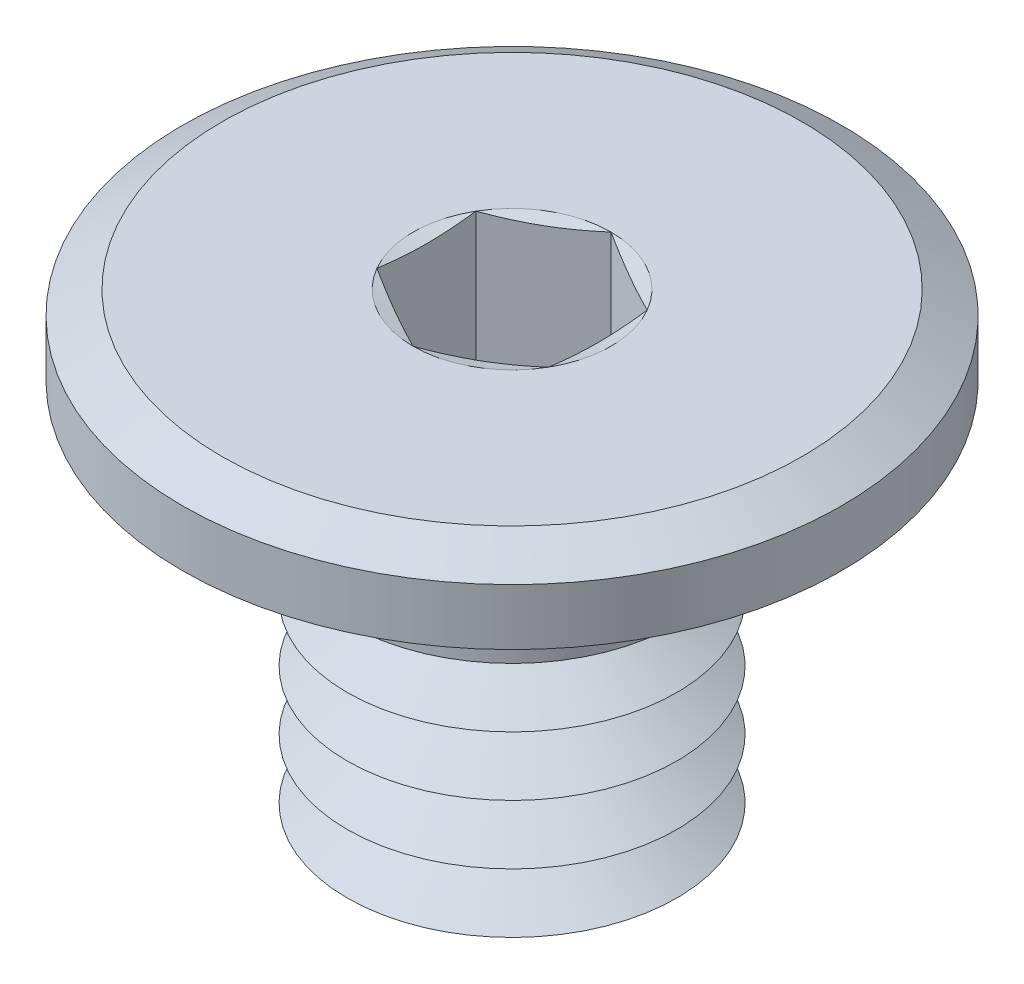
ISO-10303-21;
HEADER;
FILE_DESCRIPTION(('STEP AP214'),'2;1');
FILE_NAME('part.step','',(''),(''),'','','');
FILE_SCHEMA(('AUTOMOTIVE_DESIGN { 1 0 10303 214 1 1 1 1 }'));
ENDSEC;
DATA;
#1=APPLICATION_CONTEXT('core data for automotive mechanical design processes');
#2=APPLICATION_PROTOCOL_DEFINITION('international standard','automotive_design',2000,#1);
#3=PRODUCT_CONTEXT('',#1,'mechanical');
#4=PRODUCT('Part','Part','',(#3));
#5=PRODUCT_RELATED_PRODUCT_CATEGORY('part','',(#4));
#6=PRODUCT_DEFINITION_FORMATION('','',#4);
#7=PRODUCT_DEFINITION_CONTEXT('part definition',#1,'design');
#8=PRODUCT_DEFINITION('design','',#6,#7);
#9=PRODUCT_DEFINITION_SHAPE('','',#8);
#10=(LENGTH_UNIT() NAMED_UNIT(*) SI_UNIT(.MILLI.,.METRE.));
#11=(NAMED_UNIT(*) PLANE_ANGLE_UNIT() SI_UNIT($,.RADIAN.));
#12=(NAMED_UNIT(*) SI_UNIT($,.STERADIAN.) SOLID_ANGLE_UNIT());
#13=UNCERTAINTY_MEASURE_WITH_UNIT(LENGTH_MEASURE(1.E-05),#10,'distance_accuracy_value','');
#14=(GEOMETRIC_REPRESENTATION_CONTEXT(3) GLOBAL_UNCERTAINTY_ASSIGNED_CONTEXT((#13)) GLOBAL_UNIT_ASSIGNED_CONTEXT((#10,
#11,#12)) REPRESENTATION_CONTEXT('',''));
#15=CARTESIAN_POINT('',(0.,0.,0.));
#16=DIRECTION('',(0.,0.,1.));
#17=DIRECTION('',(1.,0.,0.));
#18=AXIS2_PLACEMENT_3D('',#15,#16,#17);
#19=CARTESIAN_POINT('',(0.,-2.925,0.));
#20=DIRECTION('',(0.,-1.,0.));
#21=DIRECTION('',(0.,0.,-1.));
#22=AXIS2_PLACEMENT_3D('',#19,#20,#21);
#23=CONICAL_SURFACE('',#22,1.25,1.0471975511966);
#24=CARTESIAN_POINT('',(0.,-2.7,0.));
#25=DIRECTION('',(0.,1.,0.));
#26=DIRECTION('',(0.,0.,1.));
#27=AXIS2_PLACEMENT_3D('',#24,#25,#26);
#28=CIRCLE('',#27,0.860288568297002);
#29=CARTESIAN_POINT('',(0.,-2.7,0.860288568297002));
#30=VERTEX_POINT('',#29);
#31=EDGE_CURVE('E394',#30,#30,#28,.T.);
#32=ORIENTED_EDGE('',*,*,#31,.F.);
#33=EDGE_LOOP('',(#32));
#34=FACE_BOUND('',#33,.T.);
#35=CARTESIAN_POINT('',(0.,-2.925,0.));
#36=DIRECTION('',(0.,1.,0.));
#37=DIRECTION('',(0.,0.,1.));
#38=AXIS2_PLACEMENT_3D('',#35,#36,#37);
#39=CIRCLE('',#38,1.25);
#40=CARTESIAN_POINT('',(0.,-2.925,1.25));
#41=VERTEX_POINT('',#40);
#42=EDGE_CURVE('E397',#41,#41,#39,.T.);
#43=ORIENTED_EDGE('',*,*,#42,.T.);
#44=EDGE_LOOP('',(#43));
#45=FACE_BOUND('',#44,.T.);
#46=ADVANCED_FACE('F39',(#34,#45),#23,.T.);
#47=CARTESIAN_POINT('',(0.,-2.7,0.));
#48=DIRECTION('',(0.,1.,0.));
#49=DIRECTION('',(0.,0.,1.));
#50=AXIS2_PLACEMENT_3D('',#47,#48,#49);
#51=CONICAL_SURFACE('',#50,0.860288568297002,1.0471975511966);
#52=CARTESIAN_POINT('',(0.,-2.475,0.));
#53=DIRECTION('',(0.,1.,0.));
#54=DIRECTION('',(0.,0.,1.));
#55=AXIS2_PLACEMENT_3D('',#52,#53,#54);
#56=CIRCLE('',#55,1.25);
#57=CARTESIAN_POINT('',(0.,-2.475,1.25));
#58=VERTEX_POINT('',#57);
#59=EDGE_CURVE('E390',#58,#58,#56,.T.);
#60=ORIENTED_EDGE('',*,*,#59,.F.);
#61=EDGE_LOOP('',(#60));
#62=FACE_BOUND('',#61,.T.);
#63=ORIENTED_EDGE('',*,*,#31,.T.);
#64=EDGE_LOOP('',(#63));
#65=FACE_BOUND('',#64,.T.);
#66=ADVANCED_FACE('F233',(#62,#65),#51,.T.);
#67=CARTESIAN_POINT('',(0.,-3.6,0.));
#68=DIRECTION('',(0.,-1.,0.));
#69=DIRECTION('',(0.,0.,-1.));
#70=AXIS2_PLACEMENT_3D('',#67,#68,#69);
#71=PLANE('',#70);
#72=CARTESIAN_POINT('',(0.,-3.6,0.));
#73=DIRECTION('',(0.,1.,0.));
#74=DIRECTION('',(0.,0.,1.));
#75=AXIS2_PLACEMENT_3D('',#72,#73,#74);
#76=CIRCLE('',#75,0.860288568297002);
#77=CARTESIAN_POINT('',(0.,-3.6,0.860288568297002));
#78=VERTEX_POINT('',#77);
#79=EDGE_CURVE('E300',#78,#78,#76,.T.);
#80=ORIENTED_EDGE('',*,*,#79,.F.);
#81=EDGE_LOOP('',(#80));
#82=FACE_BOUND('',#81,.T.);
#83=ADVANCED_FACE('F239',(#82),#71,.T.);
#84=CARTESIAN_POINT('',(0.,-3.6,0.));
#85=DIRECTION('',(0.,1.,0.));
#86=DIRECTION('',(0.,0.,1.));
#87=AXIS2_PLACEMENT_3D('',#84,#85,#86);
#88=CONICAL_SURFACE('',#87,0.860288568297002,1.0471975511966);
#89=CARTESIAN_POINT('',(0.,-3.375,0.));
#90=DIRECTION('',(0.,1.,0.));
#91=DIRECTION('',(0.,0.,1.));
#92=AXIS2_PLACEMENT_3D('',#89,#90,#91);
#93=CIRCLE('',#92,1.25);
#94=CARTESIAN_POINT('',(0.,-3.375,1.25));
#95=VERTEX_POINT('',#94);
#96=EDGE_CURVE('E405',#95,#95,#93,.T.);
#97=ORIENTED_EDGE('',*,*,#96,.F.);
#98=EDGE_LOOP('',(#97));
#99=FACE_BOUND('',#98,.T.);
#100=ORIENTED_EDGE('',*,*,#79,.T.);
#101=EDGE_LOOP('',(#100));
#102=FACE_BOUND('',#101,.T.);
#103=ADVANCED_FACE('F254',(#99,#102),#88,.T.);
#104=CARTESIAN_POINT('',(0.,-3.375,0.));
#105=DIRECTION('',(0.,-1.,0.));
#106=DIRECTION('',(0.,0.,-1.));
#107=AXIS2_PLACEMENT_3D('',#104,#105,#106);
#108=CONICAL_SURFACE('',#107,1.25,1.0471975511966);
#109=CARTESIAN_POINT('',(0.,-3.15,0.));
#110=DIRECTION('',(0.,1.,0.));
#111=DIRECTION('',(0.,0.,1.));
#112=AXIS2_PLACEMENT_3D('',#109,#110,#111);
#113=CIRCLE('',#112,0.860288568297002);
#114=CARTESIAN_POINT('',(0.,-3.15,0.860288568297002));
#115=VERTEX_POINT('',#114);
#116=EDGE_CURVE('E401',#115,#115,#113,.T.);
#117=ORIENTED_EDGE('',*,*,#116,.F.);
#118=EDGE_LOOP('',(#117));
#119=FACE_BOUND('',#118,.T.);
#120=ORIENTED_EDGE('',*,*,#96,.T.);
#121=EDGE_LOOP('',(#120));
#122=FACE_BOUND('',#121,.T.);
#123=ADVANCED_FACE('F250',(#119,#122),#108,.T.);
#124=CARTESIAN_POINT('',(0.,-3.15,0.));
#125=DIRECTION('',(0.,1.,0.));
#126=DIRECTION('',(0.,0.,1.));
#127=AXIS2_PLACEMENT_3D('',#124,#125,#126);
#128=CONICAL_SURFACE('',#127,0.860288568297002,1.0471975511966);
#129=ORIENTED_EDGE('',*,*,#42,.F.);
#130=EDGE_LOOP('',(#129));
#131=FACE_BOUND('',#130,.T.);
#132=ORIENTED_EDGE('',*,*,#116,.T.);
#133=EDGE_LOOP('',(#132));
#134=FACE_BOUND('',#133,.T.);
#135=ADVANCED_FACE('F246',(#131,#134),#128,.T.);
#136=CARTESIAN_POINT('',(0.,-2.475,0.));
#137=DIRECTION('',(0.,-1.,0.));
#138=DIRECTION('',(0.,0.,-1.));
#139=AXIS2_PLACEMENT_3D('',#136,#137,#138);
#140=CONICAL_SURFACE('',#139,1.25,1.0471975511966);
#141=CARTESIAN_POINT('',(0.,-2.25,0.));
#142=DIRECTION('',(0.,1.,0.));
#143=DIRECTION('',(0.,0.,1.));
#144=AXIS2_PLACEMENT_3D('',#141,#142,#143);
#145=CIRCLE('',#144,0.860288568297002);
#146=CARTESIAN_POINT('',(0.,-2.25,0.860288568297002));
#147=VERTEX_POINT('',#146);
#148=EDGE_CURVE('E386',#147,#147,#145,.T.);
#149=ORIENTED_EDGE('',*,*,#148,.F.);
#150=EDGE_LOOP('',(#149));
#151=FACE_BOUND('',#150,.T.);
#152=ORIENTED_EDGE('',*,*,#59,.T.);
#153=EDGE_LOOP('',(#152));
#154=FACE_BOUND('',#153,.T.);
#155=ADVANCED_FACE('F249',(#151,#154),#140,.T.);
#156=CARTESIAN_POINT('',(0.,-2.25,0.));
#157=DIRECTION('',(0.,1.,0.));
#158=DIRECTION('',(0.,0.,1.));
#159=AXIS2_PLACEMENT_3D('',#156,#157,#158);
#160=CONICAL_SURFACE('',#159,0.860288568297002,1.0471975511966);
#161=CARTESIAN_POINT('',(0.,-2.025,0.));
#162=DIRECTION('',(0.,1.,0.));
#163=DIRECTION('',(0.,0.,1.));
#164=AXIS2_PLACEMENT_3D('',#161,#162,#163);
#165=CIRCLE('',#164,1.25);
#166=CARTESIAN_POINT('',(0.,-2.025,1.25));
#167=VERTEX_POINT('',#166);
#168=EDGE_CURVE('E382',#167,#167,#165,.T.);
#169=ORIENTED_EDGE('',*,*,#168,.F.);
#170=EDGE_LOOP('',(#169));
#171=FACE_BOUND('',#170,.T.);
#172=ORIENTED_EDGE('',*,*,#148,.T.);
#173=EDGE_LOOP('',(#172));
#174=FACE_BOUND('',#173,.T.);
#175=ADVANCED_FACE('F472',(#171,#174),#160,.T.);
#176=CARTESIAN_POINT('',(0.,-2.025,0.));
#177=DIRECTION('',(0.,-1.,0.));
#178=DIRECTION('',(0.,0.,-1.));
#179=AXIS2_PLACEMENT_3D('',#176,#177,#178);
#180=CONICAL_SURFACE('',#179,1.25,1.0471975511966);
#181=CARTESIAN_POINT('',(0.,-1.8,0.));
#182=DIRECTION('',(0.,1.,0.));
#183=DIRECTION('',(0.,0.,1.));
#184=AXIS2_PLACEMENT_3D('',#181,#182,#183);
#185=CIRCLE('',#184,0.860288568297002);
#186=CARTESIAN_POINT('',(0.,-1.8,0.860288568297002));
#187=VERTEX_POINT('',#186);
#188=EDGE_CURVE('E379',#187,#187,#185,.T.);
#189=ORIENTED_EDGE('',*,*,#188,.F.);
#190=EDGE_LOOP('',(#189));
#191=FACE_BOUND('',#190,.T.);
#192=ORIENTED_EDGE('',*,*,#168,.T.);
#193=EDGE_LOOP('',(#192));
#194=FACE_BOUND('',#193,.T.);
#195=ADVANCED_FACE('F468',(#191,#194),#180,.T.);
#196=CARTESIAN_POINT('',(0.,-1.8,0.));
#197=DIRECTION('',(0.,1.,0.));
#198=DIRECTION('',(0.,0.,1.));
#199=AXIS2_PLACEMENT_3D('',#196,#197,#198);
#200=CONICAL_SURFACE('',#199,0.860288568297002,1.0471975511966);
#201=CARTESIAN_POINT('',(0.,-1.575,0.));
#202=DIRECTION('',(0.,1.,0.));
#203=DIRECTION('',(0.,0.,1.));
#204=AXIS2_PLACEMENT_3D('',#201,#202,#203);
#205=CIRCLE('',#204,1.25);
#206=CARTESIAN_POINT('',(0.,-1.575,1.25));
#207=VERTEX_POINT('',#206);
#208=EDGE_CURVE('E365',#207,#207,#205,.T.);
#209=ORIENTED_EDGE('',*,*,#208,.F.);
#210=EDGE_LOOP('',(#209));
#211=FACE_BOUND('',#210,.T.);
#212=ORIENTED_EDGE('',*,*,#188,.T.);
#213=EDGE_LOOP('',(#212));
#214=FACE_BOUND('',#213,.T.);
#215=ADVANCED_FACE('F274',(#211,#214),#200,.T.);
#216=CARTESIAN_POINT('',(0.,0.,0.));
#217=DIRECTION('',(0.,1.,0.));
#218=DIRECTION('',(0.,0.,1.));
#219=AXIS2_PLACEMENT_3D('',#216,#217,#218);
#220=PLANE('',#219);
#221=CARTESIAN_POINT('',(0.,0.,0.));
#222=DIRECTION('',(0.,1.,0.));
#223=DIRECTION('',(0.,0.,1.));
#224=AXIS2_PLACEMENT_3D('',#221,#222,#223);
#225=CIRCLE('',#224,0.750555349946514);
#226=CARTESIAN_POINT('',(0.,0.,0.750555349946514));
#227=VERTEX_POINT('',#226);
#228=CARTESIAN_POINT('',(0.65,0.,0.375277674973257));
#229=VERTEX_POINT('',#228);
#230=EDGE_CURVE('E66',#227,#229,#225,.T.);
#231=ORIENTED_EDGE('',*,*,#230,.F.);
#232=CARTESIAN_POINT('',(-0.65,0.,0.375277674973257));
#233=VERTEX_POINT('',#232);
#234=EDGE_CURVE('E169',#233,#227,#225,.T.);
#235=ORIENTED_EDGE('',*,*,#234,.F.);
#236=CARTESIAN_POINT('',(-0.65,0.,-0.375277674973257));
#237=VERTEX_POINT('',#236);
#238=EDGE_CURVE('E164',#237,#233,#225,.T.);
#239=ORIENTED_EDGE('',*,*,#238,.F.);
#240=CARTESIAN_POINT('',(0.,0.,-0.750555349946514));
#241=VERTEX_POINT('',#240);
#242=EDGE_CURVE('E128',#241,#237,#225,.T.);
#243=ORIENTED_EDGE('',*,*,#242,.F.);
#244=CARTESIAN_POINT('',(0.65,0.,-0.375277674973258));
#245=VERTEX_POINT('',#244);
#246=EDGE_CURVE('E119',#245,#241,#225,.T.);
#247=ORIENTED_EDGE('',*,*,#246,.F.);
#248=EDGE_CURVE('E59',#229,#245,#225,.T.);
#249=ORIENTED_EDGE('',*,*,#248,.F.);
#250=EDGE_LOOP('',(#231,#235,#239,#243,#247,#249));
#251=FACE_BOUND('',#250,.T.);
#252=CARTESIAN_POINT('',(0.,0.,0.));
#253=DIRECTION('',(0.,1.,0.));
#254=DIRECTION('',(0.,0.,1.));
#255=AXIS2_PLACEMENT_3D('',#252,#253,#254);
#256=CIRCLE('',#255,2.2);
#257=CARTESIAN_POINT('',(0.,0.,2.2));
#258=VERTEX_POINT('',#257);
#259=EDGE_CURVE('E296',#258,#258,#256,.T.);
#260=ORIENTED_EDGE('',*,*,#259,.T.);
#261=EDGE_LOOP('',(#260));
#262=FACE_BOUND('',#261,.T.);
#263=ADVANCED_FACE('F160',(#251,#262),#220,.T.);
#264=CARTESIAN_POINT('',(0.,-0.6,0.));
#265=DIRECTION('',(0.,1.,0.));
#266=DIRECTION('',(0.,0.,1.));
#267=AXIS2_PLACEMENT_3D('',#264,#265,#266);
#268=CYLINDRICAL_SURFACE('',#267,2.5);
#269=CARTESIAN_POINT('',(0.,-0.173205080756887,0.));
#270=DIRECTION('',(0.,1.,0.));
#271=DIRECTION('',(0.,0.,1.));
#272=AXIS2_PLACEMENT_3D('',#269,#270,#271);
#273=CIRCLE('',#272,2.5);
#274=CARTESIAN_POINT('',(0.,-0.173205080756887,2.5));
#275=VERTEX_POINT('',#274);
#276=EDGE_CURVE('E307',#275,#275,#273,.F.);
#277=ORIENTED_EDGE('',*,*,#276,.T.);
#278=EDGE_LOOP('',(#277));
#279=FACE_BOUND('',#278,.T.);
#280=CARTESIAN_POINT('',(0.,-0.6,0.));
#281=DIRECTION('',(0.,1.,0.));
#282=DIRECTION('',(0.,0.,1.));
#283=AXIS2_PLACEMENT_3D('',#280,#281,#282);
#284=CIRCLE('',#283,2.5);
#285=CARTESIAN_POINT('',(0.,-0.6,2.5));
#286=VERTEX_POINT('',#285);
#287=EDGE_CURVE('E291',#286,#286,#284,.T.);
#288=ORIENTED_EDGE('',*,*,#287,.T.);
#289=EDGE_LOOP('',(#288));
#290=FACE_BOUND('',#289,.T.);
#291=ADVANCED_FACE('F270',(#279,#290),#268,.T.);
#292=CARTESIAN_POINT('',(0.,-0.6,0.));
#293=DIRECTION('',(0.,1.,0.));
#294=DIRECTION('',(0.,0.,1.));
#295=AXIS2_PLACEMENT_3D('',#292,#293,#294);
#296=PLANE('',#295);
#297=CARTESIAN_POINT('',(0.,-0.6,0.));
#298=DIRECTION('',(0.,1.,0.));
#299=DIRECTION('',(0.,0.,1.));
#300=AXIS2_PLACEMENT_3D('',#297,#298,#299);
#301=CIRCLE('',#300,1.35);
#302=CARTESIAN_POINT('',(0.,-0.6,1.35));
#303=VERTEX_POINT('',#302);
#304=EDGE_CURVE('E286',#303,#303,#301,.T.);
#305=ORIENTED_EDGE('',*,*,#304,.T.);
#306=EDGE_LOOP('',(#305));
#307=FACE_BOUND('',#306,.T.);
#308=ORIENTED_EDGE('',*,*,#287,.F.);
#309=EDGE_LOOP('',(#308));
#310=FACE_BOUND('',#309,.T.);
#311=ADVANCED_FACE('F266',(#307,#310),#296,.F.);
#312=CARTESIAN_POINT('',(0.,-3.6,0.));
#313=DIRECTION('',(0.,1.,0.));
#314=DIRECTION('',(0.,0.,1.));
#315=AXIS2_PLACEMENT_3D('',#312,#313,#314);
#316=CYLINDRICAL_SURFACE('',#315,1.25);
#317=CARTESIAN_POINT('',(0.,-0.7,0.));
#318=DIRECTION('',(0.,1.,0.));
#319=DIRECTION('',(0.,0.,1.));
#320=AXIS2_PLACEMENT_3D('',#317,#318,#319);
#321=CIRCLE('',#320,1.25);
#322=CARTESIAN_POINT('',(0.,-0.7,1.25));
#323=VERTEX_POINT('',#322);
#324=EDGE_CURVE('E289',#323,#323,#321,.F.);
#325=ORIENTED_EDGE('',*,*,#324,.T.);
#326=EDGE_LOOP('',(#325));
#327=FACE_BOUND('',#326,.T.);
#328=ORIENTED_EDGE('',*,*,#208,.T.);
#329=EDGE_LOOP('',(#328));
#330=FACE_BOUND('',#329,.T.);
#331=ADVANCED_FACE('F262',(#327,#330),#316,.T.);
#332=CARTESIAN_POINT('',(0.,-0.7,0.));
#333=DIRECTION('',(0.,1.,0.));
#334=DIRECTION('',(0.,0.,1.));
#335=AXIS2_PLACEMENT_3D('',#332,#333,#334);
#336=TOROIDAL_SURFACE('',#335,1.35,0.1);
#337=ORIENTED_EDGE('',*,*,#304,.F.);
#338=EDGE_LOOP('',(#337));
#339=FACE_BOUND('',#338,.T.);
#340=ORIENTED_EDGE('',*,*,#324,.F.);
#341=EDGE_LOOP('',(#340));
#342=FACE_BOUND('',#341,.T.);
#343=ADVANCED_FACE('F265',(#339,#342),#336,.F.);
#344=CARTESIAN_POINT('',(0.,0.,0.));
#345=DIRECTION('',(0.,-1.,0.));
#346=DIRECTION('',(0.,0.,-1.));
#347=AXIS2_PLACEMENT_3D('',#344,#345,#346);
#348=CONICAL_SURFACE('',#347,2.2,1.0471975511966);
#349=ORIENTED_EDGE('',*,*,#276,.F.);
#350=EDGE_LOOP('',(#349));
#351=FACE_BOUND('',#350,.T.);
#352=ORIENTED_EDGE('',*,*,#259,.F.);
#353=EDGE_LOOP('',(#352));
#354=FACE_BOUND('',#353,.T.);
#355=ADVANCED_FACE('F41',(#351,#354),#348,.T.);
#356=CARTESIAN_POINT('',(0.,0.,0.));
#357=DIRECTION('',(0.,1.,0.));
#358=DIRECTION('',(0.,0.,1.));
#359=AXIS2_PLACEMENT_3D('',#356,#357,#358);
#360=CONICAL_SURFACE('',#359,0.750555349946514,1.30899693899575);
#361=ORIENTED_EDGE('',*,*,#242,.T.);
#362=CARTESIAN_POINT('',(0.000200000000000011,3.09472466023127E-05,-0.750670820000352));
#363=CARTESIAN_POINT('',(-0.0268094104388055,-0.00415092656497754,-0.735076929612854));
#364=CARTESIAN_POINT('',(-0.0538678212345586,-0.00794750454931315,-0.719454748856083));
#365=CARTESIAN_POINT('',(-0.108080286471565,-0.0146178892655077,-0.688155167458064));
#366=CARTESIAN_POINT('',(-0.135234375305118,-0.0174913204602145,-0.672477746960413));
#367=CARTESIAN_POINT('',(-0.18947340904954,-0.0221475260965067,-0.641162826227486));
#368=CARTESIAN_POINT('',(-0.216557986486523,-0.0239358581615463,-0.625525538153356));
#369=CARTESIAN_POINT('',(-0.270761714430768,-0.0263338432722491,-0.594231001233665));
#370=CARTESIAN_POINT('',(-0.297880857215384,-0.0269437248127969,-0.578573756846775));
#371=CARTESIAN_POINT('',(-0.352119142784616,-0.0269437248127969,-0.547259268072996));
#372=CARTESIAN_POINT('',(-0.379238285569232,-0.0263338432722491,-0.531602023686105));
#373=CARTESIAN_POINT('',(-0.433442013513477,-0.0239358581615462,-0.500307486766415));
#374=CARTESIAN_POINT('',(-0.460526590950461,-0.0221475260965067,-0.484670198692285));
#375=CARTESIAN_POINT('',(-0.514765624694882,-0.0174913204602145,-0.453355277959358));
#376=CARTESIAN_POINT('',(-0.541919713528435,-0.0146178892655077,-0.437677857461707));
#377=CARTESIAN_POINT('',(-0.596132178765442,-0.00794750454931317,-0.406378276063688));
#378=CARTESIAN_POINT('',(-0.623190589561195,-0.00415092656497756,-0.390756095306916));
#379=CARTESIAN_POINT('',(-0.6502,3.09472466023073E-05,-0.375162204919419));
#380=B_SPLINE_CURVE_WITH_KNOTS('',3,(#362,#363,#364,#365,#366,#367,#368,#369,#370,#371,#372,
#373,#374,#375,#376,#377,#378,#379),.UNSPECIFIED.,.F.,.F.,(4,2,2,2,2,2,2,2,4),(0.,
0.0944056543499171,0.188849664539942,0.282805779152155,0.376743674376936,0.470681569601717,
0.564637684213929,0.659081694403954,0.753487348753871),.UNSPECIFIED.);
#381=EDGE_CURVE('E11',#241,#237,#380,.T.);
#382=ORIENTED_EDGE('',*,*,#381,.F.);
#383=EDGE_LOOP('',(#361,#382));
#384=FACE_BOUND('',#383,.T.);
#385=ADVANCED_FACE('F132',(#384),#360,.F.);
#386=ORIENTED_EDGE('',*,*,#238,.T.);
#387=CARTESIAN_POINT('',(-0.65,0.153431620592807,-1.15250975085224));
#388=CARTESIAN_POINT('',(-0.65,0.140485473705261,-1.09696292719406));
#389=CARTESIAN_POINT('',(-0.65,0.12772104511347,-1.04137089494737));
#390=CARTESIAN_POINT('',(-0.65,0.102806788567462,-0.93003898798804));
#391=CARTESIAN_POINT('',(-0.65,0.0906570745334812,-0.874299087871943));
#392=CARTESIAN_POINT('',(-0.65,0.0671143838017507,-0.762091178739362));
#393=CARTESIAN_POINT('',(-0.65,0.0557299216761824,-0.70562136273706));
#394=CARTESIAN_POINT('',(-0.65,0.0342960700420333,-0.59241870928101));
#395=CARTESIAN_POINT('',(-0.65,0.0242468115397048,-0.535685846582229));
#396=CARTESIAN_POINT('',(-0.65,0.00641278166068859,-0.423455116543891));
#397=CARTESIAN_POINT('',(-0.65,-0.00142665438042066,-0.367966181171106));
#398=CARTESIAN_POINT('',(-0.65,-0.0143371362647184,-0.256669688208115));
#399=CARTESIAN_POINT('',(-0.65,-0.0194090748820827,-0.200862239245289));
#400=CARTESIAN_POINT('',(-0.65,-0.025908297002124,-0.0892782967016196));
#401=CARTESIAN_POINT('',(-0.65,-0.0273521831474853,-0.0335028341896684));
#402=CARTESIAN_POINT('',(-0.65,-0.0263311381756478,0.078014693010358));
#403=CARTESIAN_POINT('',(-0.65,-0.0238659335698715,0.133756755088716));
#404=CARTESIAN_POINT('',(-0.65,-0.016691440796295,0.229596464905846));
#405=CARTESIAN_POINT('',(-0.65,-0.0127907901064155,0.269759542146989));
#406=CARTESIAN_POINT('',(-0.65,-0.00354681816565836,0.349915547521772));
#407=CARTESIAN_POINT('',(-0.65,0.00179646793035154,0.389908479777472));
#408=CARTESIAN_POINT('',(-0.65,0.0195190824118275,0.50990254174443));
#409=CARTESIAN_POINT('',(-0.65,0.0335668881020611,0.589653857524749));
#410=CARTESIAN_POINT('',(-0.65,0.0566589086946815,0.709742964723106));
#411=CARTESIAN_POINT('',(-0.65,0.0647873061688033,0.750268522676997));
#412=CARTESIAN_POINT('',(-0.65,0.0815416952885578,0.831218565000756));
#413=CARTESIAN_POINT('',(-0.65,0.0901676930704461,0.871643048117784));
#414=CARTESIAN_POINT('',(-0.65,0.107740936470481,0.952178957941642));
#415=CARTESIAN_POINT('',(-0.65,0.116686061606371,0.992290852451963));
#416=CARTESIAN_POINT('',(-0.65,0.134863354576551,1.07244661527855));
#417=CARTESIAN_POINT('',(-0.65,0.144095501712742,1.11249048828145));
#418=CARTESIAN_POINT('',(-0.65,0.153431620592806,1.15250975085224));
#419=B_SPLINE_CURVE_WITH_KNOTS('',3,(#387,#388,#389,#390,#391,#392,#393,#394,#395,#396,#397,
#398,#399,#400,#401,#402,#403,#404,#405,#406,#407,#408,#409,#410,#411,#412,#413,#414,#415,#416,
#417,#418),.UNSPECIFIED.,.F.,.F.,(4,2,2,2,2,2,2,2,2,2,2,2,2,2,2,4),(0.,0.171110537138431,
0.342252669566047,0.515060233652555,0.687884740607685,0.855957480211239,1.02397596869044,
1.19122416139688,1.3584840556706,1.4795115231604,1.60053604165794,1.84338230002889,
1.9673809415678,2.09138111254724,2.21467179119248,2.33795359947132),.UNSPECIFIED.);
#420=EDGE_CURVE('E172',#237,#233,#419,.T.);
#421=ORIENTED_EDGE('',*,*,#420,.F.);
#422=EDGE_LOOP('',(#386,#421));
#423=FACE_BOUND('',#422,.T.);
#424=ADVANCED_FACE('F524',(#423),#360,.F.);
#425=ORIENTED_EDGE('',*,*,#234,.T.);
#426=CARTESIAN_POINT('',(-0.6502,3.09472466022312E-05,0.375162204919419));
#427=CARTESIAN_POINT('',(-0.623190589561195,-0.0041509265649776,0.390756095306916));
#428=CARTESIAN_POINT('',(-0.596132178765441,-0.00794750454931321,0.406378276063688));
#429=CARTESIAN_POINT('',(-0.541919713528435,-0.0146178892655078,0.437677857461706));
#430=CARTESIAN_POINT('',(-0.514765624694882,-0.0174913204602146,0.453355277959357));
#431=CARTESIAN_POINT('',(-0.460526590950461,-0.0221475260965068,0.484670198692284));
#432=CARTESIAN_POINT('',(-0.433442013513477,-0.0239358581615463,0.500307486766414));
#433=CARTESIAN_POINT('',(-0.379238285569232,-0.0263338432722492,0.531602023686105));
#434=CARTESIAN_POINT('',(-0.352119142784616,-0.026943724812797,0.547259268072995));
#435=CARTESIAN_POINT('',(-0.297880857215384,-0.026943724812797,0.578573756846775));
#436=CARTESIAN_POINT('',(-0.270761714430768,-0.0263338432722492,0.594231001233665));
#437=CARTESIAN_POINT('',(-0.216557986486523,-0.0239358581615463,0.625525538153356));
#438=CARTESIAN_POINT('',(-0.18947340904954,-0.0221475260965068,0.641162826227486));
#439=CARTESIAN_POINT('',(-0.135234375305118,-0.0174913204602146,0.672477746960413));
#440=CARTESIAN_POINT('',(-0.108080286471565,-0.0146178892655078,0.688155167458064));
#441=CARTESIAN_POINT('',(-0.0538678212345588,-0.00794750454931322,0.719454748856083));
#442=CARTESIAN_POINT('',(-0.0268094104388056,-0.0041509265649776,0.735076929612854));
#443=CARTESIAN_POINT('',(0.000199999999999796,3.09472466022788E-05,0.750670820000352));
#444=B_SPLINE_CURVE_WITH_KNOTS('',3,(#426,#427,#428,#429,#430,#431,#432,#433,#434,#435,#436,
#437,#438,#439,#440,#441,#442,#443),.UNSPECIFIED.,.F.,.F.,(4,2,2,2,2,2,2,2,4),(0.,
0.0944056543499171,0.188849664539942,0.282805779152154,0.376743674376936,0.470681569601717,
0.564637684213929,0.659081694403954,0.753487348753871),.UNSPECIFIED.);
#445=EDGE_CURVE('E180',#233,#227,#444,.T.);
#446=ORIENTED_EDGE('',*,*,#445,.F.);
#447=EDGE_LOOP('',(#425,#446));
#448=FACE_BOUND('',#447,.T.);
#449=ADVANCED_FACE('F531',(#448),#360,.F.);
#450=ORIENTED_EDGE('',*,*,#230,.T.);
#451=CARTESIAN_POINT('',(-0.000200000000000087,3.09472466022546E-05,0.750670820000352));
#452=CARTESIAN_POINT('',(0.0268094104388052,-0.00415092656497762,0.735076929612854));
#453=CARTESIAN_POINT('',(0.0538678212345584,-0.00794750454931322,0.719454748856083));
#454=CARTESIAN_POINT('',(0.108080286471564,-0.0146178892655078,0.688155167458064));
#455=CARTESIAN_POINT('',(0.135234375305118,-0.0174913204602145,0.672477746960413));
#456=CARTESIAN_POINT('',(0.189473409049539,-0.0221475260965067,0.641162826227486));
#457=CARTESIAN_POINT('',(0.216557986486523,-0.0239358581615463,0.625525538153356));
#458=CARTESIAN_POINT('',(0.270761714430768,-0.0263338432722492,0.594231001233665));
#459=CARTESIAN_POINT('',(0.297880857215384,-0.0269437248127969,0.578573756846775));
#460=CARTESIAN_POINT('',(0.352119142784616,-0.0269437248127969,0.547259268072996));
#461=CARTESIAN_POINT('',(0.379238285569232,-0.0263338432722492,0.531602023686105));
#462=CARTESIAN_POINT('',(0.433442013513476,-0.0239358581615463,0.500307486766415));
#463=CARTESIAN_POINT('',(0.46052659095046,-0.0221475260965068,0.484670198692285));
#464=CARTESIAN_POINT('',(0.514765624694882,-0.0174913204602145,0.453355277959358));
#465=CARTESIAN_POINT('',(0.541919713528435,-0.0146178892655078,0.437677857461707));
#466=CARTESIAN_POINT('',(0.596132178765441,-0.00794750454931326,0.406378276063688));
#467=CARTESIAN_POINT('',(0.623190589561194,-0.00415092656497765,0.390756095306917));
#468=CARTESIAN_POINT('',(0.6502,3.09472466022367E-05,0.375162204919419));
#469=B_SPLINE_CURVE_WITH_KNOTS('',3,(#451,#452,#453,#454,#455,#456,#457,#458,#459,#460,#461,
#462,#463,#464,#465,#466,#467,#468),.UNSPECIFIED.,.F.,.F.,(4,2,2,2,2,2,2,2,4),(0.,
0.0944056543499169,0.188849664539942,0.282805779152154,0.376743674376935,0.470681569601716,
0.564637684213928,0.659081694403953,0.753487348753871),.UNSPECIFIED.);
#470=EDGE_CURVE('E199',#227,#229,#469,.T.);
#471=ORIENTED_EDGE('',*,*,#470,.F.);
#472=EDGE_LOOP('',(#450,#471));
#473=FACE_BOUND('',#472,.T.);
#474=ADVANCED_FACE('F539',(#473),#360,.F.);
#475=ORIENTED_EDGE('',*,*,#248,.T.);
#476=CARTESIAN_POINT('',(0.65,0.153431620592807,1.15250975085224));
#477=CARTESIAN_POINT('',(0.65,0.140485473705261,1.09696292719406));
#478=CARTESIAN_POINT('',(0.65,0.12772104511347,1.04137089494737));
#479=CARTESIAN_POINT('',(0.65,0.102806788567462,0.93003898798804));
#480=CARTESIAN_POINT('',(0.65,0.0906570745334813,0.874299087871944));
#481=CARTESIAN_POINT('',(0.65,0.0671143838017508,0.762091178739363));
#482=CARTESIAN_POINT('',(0.65,0.0557299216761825,0.705621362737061));
#483=CARTESIAN_POINT('',(0.65,0.0342960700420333,0.592418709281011));
#484=CARTESIAN_POINT('',(0.65,0.0242468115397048,0.53568584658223));
#485=CARTESIAN_POINT('',(0.65,0.00641278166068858,0.423455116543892));
#486=CARTESIAN_POINT('',(0.65,-0.00142665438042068,0.367966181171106));
#487=CARTESIAN_POINT('',(0.65,-0.0143371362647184,0.256669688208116));
#488=CARTESIAN_POINT('',(0.65,-0.0194090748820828,0.200862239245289));
#489=CARTESIAN_POINT('',(0.65,-0.0259082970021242,0.08927829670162));
#490=CARTESIAN_POINT('',(0.65,-0.0273521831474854,0.0335028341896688));
#491=CARTESIAN_POINT('',(0.65,-0.0263311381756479,-0.0780146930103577));
#492=CARTESIAN_POINT('',(0.65,-0.0238659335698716,-0.133756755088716));
#493=CARTESIAN_POINT('',(0.65,-0.0166914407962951,-0.229596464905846));
#494=CARTESIAN_POINT('',(0.65,-0.0127907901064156,-0.269759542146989));
#495=CARTESIAN_POINT('',(0.65,-0.00354681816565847,-0.349915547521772));
#496=CARTESIAN_POINT('',(0.65,0.00179646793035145,-0.389908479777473));
#497=CARTESIAN_POINT('',(0.65,0.0195190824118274,-0.509902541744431));
#498=CARTESIAN_POINT('',(0.649999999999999,0.033566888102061,-0.589653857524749));
#499=CARTESIAN_POINT('',(0.649999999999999,0.0566589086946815,-0.709742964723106));
#500=CARTESIAN_POINT('',(0.649999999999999,0.0647873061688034,-0.750268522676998));
#501=CARTESIAN_POINT('',(0.649999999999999,0.081541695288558,-0.831218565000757));
#502=CARTESIAN_POINT('',(0.649999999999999,0.0901676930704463,-0.871643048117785));
#503=CARTESIAN_POINT('',(0.649999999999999,0.107740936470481,-0.952178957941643));
#504=CARTESIAN_POINT('',(0.649999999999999,0.116686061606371,-0.992290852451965));
#505=CARTESIAN_POINT('',(0.649999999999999,0.134863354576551,-1.07244661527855));
#506=CARTESIAN_POINT('',(0.649999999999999,0.144095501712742,-1.11249048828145));
#507=CARTESIAN_POINT('',(0.649999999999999,0.153431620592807,-1.15250975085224));
#508=B_SPLINE_CURVE_WITH_KNOTS('',3,(#476,#477,#478,#479,#480,#481,#482,#483,#484,#485,#486,
#487,#488,#489,#490,#491,#492,#493,#494,#495,#496,#497,#498,#499,#500,#501,#502,#503,#504,#505,
#506,#507),.UNSPECIFIED.,.F.,.F.,(4,2,2,2,2,2,2,2,2,2,2,2,2,2,2,4),(0.,0.171110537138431,
0.342252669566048,0.515060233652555,0.687884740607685,0.855957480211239,1.02397596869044,
1.19122416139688,1.3584840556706,1.47951152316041,1.60053604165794,1.84338230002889,
1.9673809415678,2.09138111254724,2.21467179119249,2.33795359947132),.UNSPECIFIED.);
#509=EDGE_CURVE('E149',#229,#245,#508,.T.);
#510=ORIENTED_EDGE('',*,*,#509,.F.);
#511=EDGE_LOOP('',(#475,#510));
#512=FACE_BOUND('',#511,.T.);
#513=ADVANCED_FACE('F192',(#512),#360,.F.);
#514=ORIENTED_EDGE('',*,*,#246,.T.);
#515=CARTESIAN_POINT('',(0.6502,3.09472466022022E-05,-0.375162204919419));
#516=CARTESIAN_POINT('',(0.623190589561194,-0.00415092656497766,-0.390756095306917));
#517=CARTESIAN_POINT('',(0.596132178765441,-0.00794750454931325,-0.406378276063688));
#518=CARTESIAN_POINT('',(0.541919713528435,-0.0146178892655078,-0.437677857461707));
#519=CARTESIAN_POINT('',(0.514765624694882,-0.0174913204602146,-0.453355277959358));
#520=CARTESIAN_POINT('',(0.46052659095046,-0.0221475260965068,-0.484670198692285));
#521=CARTESIAN_POINT('',(0.433442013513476,-0.0239358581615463,-0.500307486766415));
#522=CARTESIAN_POINT('',(0.379238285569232,-0.0263338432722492,-0.531602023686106));
#523=CARTESIAN_POINT('',(0.352119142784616,-0.0269437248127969,-0.547259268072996));
#524=CARTESIAN_POINT('',(0.297880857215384,-0.0269437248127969,-0.578573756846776));
#525=CARTESIAN_POINT('',(0.270761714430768,-0.0263338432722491,-0.594231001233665));
#526=CARTESIAN_POINT('',(0.216557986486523,-0.0239358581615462,-0.625525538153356));
#527=CARTESIAN_POINT('',(0.189473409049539,-0.0221475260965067,-0.641162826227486));
#528=CARTESIAN_POINT('',(0.135234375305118,-0.0174913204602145,-0.672477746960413));
#529=CARTESIAN_POINT('',(0.108080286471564,-0.0146178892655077,-0.688155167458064));
#530=CARTESIAN_POINT('',(0.0538678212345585,-0.00794750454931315,-0.719454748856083));
#531=CARTESIAN_POINT('',(0.0268094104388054,-0.00415092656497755,-0.735076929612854));
#532=CARTESIAN_POINT('',(-0.000200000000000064,3.09472466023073E-05,-0.750670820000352));
#533=B_SPLINE_CURVE_WITH_KNOTS('',3,(#515,#516,#517,#518,#519,#520,#521,#522,#523,#524,#525,
#526,#527,#528,#529,#530,#531,#532),.UNSPECIFIED.,.F.,.F.,(4,2,2,2,2,2,2,2,4),(0.,
0.0944056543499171,0.188849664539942,0.282805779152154,0.376743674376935,0.470681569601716,
0.564637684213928,0.659081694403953,0.75348734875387),.UNSPECIFIED.);
#534=EDGE_CURVE('E123',#245,#241,#533,.T.);
#535=ORIENTED_EDGE('',*,*,#534,.F.);
#536=EDGE_LOOP('',(#514,#535));
#537=FACE_BOUND('',#536,.T.);
#538=ADVANCED_FACE('F121',(#537),#360,.F.);
#539=CARTESIAN_POINT('',(0.,-1.2,0.));
#540=DIRECTION('',(0.,1.,0.));
#541=DIRECTION('',(0.,0.,1.));
#542=AXIS2_PLACEMENT_3D('',#539,#540,#541);
#543=CONICAL_SURFACE('',#542,0.65,1.0471975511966);
#544=CARTESIAN_POINT('',(0.,-1.57527767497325,0.));
#545=VERTEX_POINT('',#544);
#546=VERTEX_LOOP('',#545);
#547=FACE_BOUND('',#546,.T.);
#548=CARTESIAN_POINT('',(0.,-1.2,0.));
#549=DIRECTION('',(0.,1.,0.));
#550=DIRECTION('',(0.,0.,1.));
#551=AXIS2_PLACEMENT_3D('',#548,#549,#550);
#552=CIRCLE('',#551,0.65);
#553=CARTESIAN_POINT('',(0.325,-1.2,0.562916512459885));
#554=VERTEX_POINT('',#553);
#555=CARTESIAN_POINT('',(0.65,-1.2,0.));
#556=VERTEX_POINT('',#555);
#557=EDGE_CURVE('E148',#554,#556,#552,.T.);
#558=ORIENTED_EDGE('',*,*,#557,.T.);
#559=CARTESIAN_POINT('',(0.,-1.2,0.));
#560=DIRECTION('',(0.,1.,0.));
#561=DIRECTION('',(0.,0.,1.));
#562=AXIS2_PLACEMENT_3D('',#559,#560,#561);
#563=CIRCLE('',#562,0.65);
#564=CARTESIAN_POINT('',(0.325,-1.2,-0.562916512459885));
#565=VERTEX_POINT('',#564);
#566=EDGE_CURVE('E53',#556,#565,#563,.T.);
#567=ORIENTED_EDGE('',*,*,#566,.T.);
#568=CARTESIAN_POINT('',(-0.325,-1.2,-0.562916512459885));
#569=VERTEX_POINT('',#568);
#570=EDGE_CURVE('E321',#565,#569,#563,.T.);
#571=ORIENTED_EDGE('',*,*,#570,.T.);
#572=CARTESIAN_POINT('',(-0.65,-1.2,0.));
#573=VERTEX_POINT('',#572);
#574=EDGE_CURVE('E319',#569,#573,#563,.T.);
#575=ORIENTED_EDGE('',*,*,#574,.T.);
#576=CARTESIAN_POINT('',(-0.325,-1.2,0.562916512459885));
#577=VERTEX_POINT('',#576);
#578=EDGE_CURVE('E312',#573,#577,#563,.T.);
#579=ORIENTED_EDGE('',*,*,#578,.T.);
#580=EDGE_CURVE('E310',#577,#554,#563,.T.);
#581=ORIENTED_EDGE('',*,*,#580,.T.);
#582=EDGE_LOOP('',(#558,#567,#571,#575,#579,#581));
#583=FACE_BOUND('',#582,.T.);
#584=ADVANCED_FACE('F191',(#547,#583),#543,.F.);
#585=CARTESIAN_POINT('',(0.,-1.2,0.));
#586=DIRECTION('',(0.,1.,0.));
#587=DIRECTION('',(0.,0.,1.));
#588=AXIS2_PLACEMENT_3D('',#585,#586,#587);
#589=PLANE('',#588);
#590=ORIENTED_EDGE('',*,*,#566,.F.);
#591=DIRECTION('',(0.,0.,-1.));
#592=VECTOR('',#591,1.);
#593=CARTESIAN_POINT('',(0.65,-1.2,0.375277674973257));
#594=LINE('',#593,#592);
#595=CARTESIAN_POINT('',(0.65,-1.2,-0.375277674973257));
#596=VERTEX_POINT('',#595);
#597=EDGE_CURVE('E361',#556,#596,#594,.T.);
#598=ORIENTED_EDGE('',*,*,#597,.T.);
#599=DIRECTION('',(-0.866025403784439,0.,-0.5));
#600=VECTOR('',#599,1.);
#601=CARTESIAN_POINT('',(0.65,-1.2,-0.375277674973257));
#602=LINE('',#601,#600);
#603=EDGE_CURVE('E413',#596,#565,#602,.T.);
#604=ORIENTED_EDGE('',*,*,#603,.T.);
#605=EDGE_LOOP('',(#590,#598,#604));
#606=FACE_BOUND('',#605,.T.);
#607=ADVANCED_FACE('F423',(#606),#589,.T.);
#608=ORIENTED_EDGE('',*,*,#557,.F.);
#609=DIRECTION('',(0.866025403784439,0.,-0.5));
#610=VECTOR('',#609,1.);
#611=CARTESIAN_POINT('',(0.,-1.2,0.750555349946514));
#612=LINE('',#611,#610);
#613=CARTESIAN_POINT('',(0.65,-1.2,0.375277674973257));
#614=VERTEX_POINT('',#613);
#615=EDGE_CURVE('E356',#554,#614,#612,.T.);
#616=ORIENTED_EDGE('',*,*,#615,.T.);
#617=EDGE_CURVE('E157',#614,#556,#594,.T.);
#618=ORIENTED_EDGE('',*,*,#617,.T.);
#619=EDGE_LOOP('',(#608,#616,#618));
#620=FACE_BOUND('',#619,.T.);
#621=ADVANCED_FACE('F425',(#620),#589,.T.);
#622=ORIENTED_EDGE('',*,*,#580,.F.);
#623=DIRECTION('',(0.866025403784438,0.,0.5));
#624=VECTOR('',#623,1.);
#625=CARTESIAN_POINT('',(-0.65,-1.2,0.375277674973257));
#626=LINE('',#625,#624);
#627=CARTESIAN_POINT('',(0.,-1.2,0.750555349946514));
#628=VERTEX_POINT('',#627);
#629=EDGE_CURVE('E349',#577,#628,#626,.T.);
#630=ORIENTED_EDGE('',*,*,#629,.T.);
#631=EDGE_CURVE('E357',#628,#554,#612,.T.);
#632=ORIENTED_EDGE('',*,*,#631,.T.);
#633=EDGE_LOOP('',(#622,#630,#632));
#634=FACE_BOUND('',#633,.T.);
#635=ADVANCED_FACE('F220',(#634),#589,.T.);
#636=ORIENTED_EDGE('',*,*,#578,.F.);
#637=DIRECTION('',(0.,0.,1.));
#638=VECTOR('',#637,1.);
#639=CARTESIAN_POINT('',(-0.65,-1.2,-0.375277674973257));
#640=LINE('',#639,#638);
#641=CARTESIAN_POINT('',(-0.65,-1.2,0.375277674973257));
#642=VERTEX_POINT('',#641);
#643=EDGE_CURVE('E337',#573,#642,#640,.T.);
#644=ORIENTED_EDGE('',*,*,#643,.T.);
#645=EDGE_CURVE('E340',#642,#577,#626,.T.);
#646=ORIENTED_EDGE('',*,*,#645,.T.);
#647=EDGE_LOOP('',(#636,#644,#646));
#648=FACE_BOUND('',#647,.T.);
#649=ADVANCED_FACE('F336',(#648),#589,.T.);
#650=ORIENTED_EDGE('',*,*,#570,.F.);
#651=CARTESIAN_POINT('',(0.,-1.2,-0.750555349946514));
#652=VERTEX_POINT('',#651);
#653=EDGE_CURVE('E416',#565,#652,#602,.T.);
#654=ORIENTED_EDGE('',*,*,#653,.T.);
#655=DIRECTION('',(-0.866025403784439,0.,0.5));
#656=VECTOR('',#655,1.);
#657=CARTESIAN_POINT('',(0.,-1.2,-0.750555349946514));
#658=LINE('',#657,#656);
#659=EDGE_CURVE('E154',#652,#569,#658,.T.);
#660=ORIENTED_EDGE('',*,*,#659,.T.);
#661=EDGE_LOOP('',(#650,#654,#660));
#662=FACE_BOUND('',#661,.T.);
#663=ADVANCED_FACE('F444',(#662),#589,.T.);
#664=ORIENTED_EDGE('',*,*,#574,.F.);
#665=CARTESIAN_POINT('',(-0.65,-1.2,-0.375277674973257));
#666=VERTEX_POINT('',#665);
#667=EDGE_CURVE('E347',#569,#666,#658,.T.);
#668=ORIENTED_EDGE('',*,*,#667,.T.);
#669=EDGE_CURVE('E342',#666,#573,#640,.T.);
#670=ORIENTED_EDGE('',*,*,#669,.T.);
#671=EDGE_LOOP('',(#664,#668,#670));
#672=FACE_BOUND('',#671,.T.);
#673=ADVANCED_FACE('F346',(#672),#589,.T.);
#674=CARTESIAN_POINT('',(0.,-1.2,-0.750555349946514));
#675=DIRECTION('',(-0.5,0.,-0.866025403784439));
#676=DIRECTION('',(-0.866025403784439,0.,0.5));
#677=AXIS2_PLACEMENT_3D('',#674,#675,#676);
#678=PLANE('',#677);
#679=DIRECTION('',(0.,1.,0.));
#680=VECTOR('',#679,1.);
#681=CARTESIAN_POINT('',(0.,-1.2,-0.750555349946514));
#682=LINE('',#681,#680);
#683=EDGE_CURVE('E142',#652,#241,#682,.T.);
#684=ORIENTED_EDGE('',*,*,#683,.T.);
#685=ORIENTED_EDGE('',*,*,#381,.T.);
#686=DIRECTION('',(0.,1.,0.));
#687=VECTOR('',#686,1.);
#688=CARTESIAN_POINT('',(-0.65,-1.2,-0.375277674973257));
#689=LINE('',#688,#687);
#690=EDGE_CURVE('E156',#666,#237,#689,.T.);
#691=ORIENTED_EDGE('',*,*,#690,.F.);
#692=ORIENTED_EDGE('',*,*,#667,.F.);
#693=ORIENTED_EDGE('',*,*,#659,.F.);
#694=EDGE_LOOP('',(#684,#685,#691,#692,#693));
#695=FACE_BOUND('',#694,.T.);
#696=ADVANCED_FACE('F151',(#695),#678,.F.);
#697=CARTESIAN_POINT('',(-0.65,-1.2,-0.375277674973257));
#698=DIRECTION('',(-1.,0.,0.));
#699=DIRECTION('',(0.,0.,1.));
#700=AXIS2_PLACEMENT_3D('',#697,#698,#699);
#701=PLANE('',#700);
#702=ORIENTED_EDGE('',*,*,#690,.T.);
#703=ORIENTED_EDGE('',*,*,#420,.T.);
#704=DIRECTION('',(0.,1.,0.));
#705=VECTOR('',#704,1.);
#706=CARTESIAN_POINT('',(-0.65,-1.2,0.375277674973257));
#707=LINE('',#706,#705);
#708=EDGE_CURVE('E343',#642,#233,#707,.T.);
#709=ORIENTED_EDGE('',*,*,#708,.F.);
#710=ORIENTED_EDGE('',*,*,#643,.F.);
#711=ORIENTED_EDGE('',*,*,#669,.F.);
#712=EDGE_LOOP('',(#702,#703,#709,#710,#711));
#713=FACE_BOUND('',#712,.T.);
#714=ADVANCED_FACE('F186',(#713),#701,.F.);
#715=CARTESIAN_POINT('',(-0.65,-1.2,0.375277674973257));
#716=DIRECTION('',(-0.5,0.,0.866025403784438));
#717=DIRECTION('',(0.866025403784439,0.,0.5));
#718=AXIS2_PLACEMENT_3D('',#715,#716,#717);
#719=PLANE('',#718);
#720=ORIENTED_EDGE('',*,*,#708,.T.);
#721=ORIENTED_EDGE('',*,*,#445,.T.);
#722=DIRECTION('',(0.,1.,0.));
#723=VECTOR('',#722,1.);
#724=CARTESIAN_POINT('',(0.,-1.2,0.750555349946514));
#725=LINE('',#724,#723);
#726=EDGE_CURVE('E370',#628,#227,#725,.T.);
#727=ORIENTED_EDGE('',*,*,#726,.F.);
#728=ORIENTED_EDGE('',*,*,#629,.F.);
#729=ORIENTED_EDGE('',*,*,#645,.F.);
#730=EDGE_LOOP('',(#720,#721,#727,#728,#729));
#731=FACE_BOUND('',#730,.T.);
#732=ADVANCED_FACE('F223',(#731),#719,.F.);
#733=CARTESIAN_POINT('',(0.,-1.2,0.750555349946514));
#734=DIRECTION('',(0.5,0.,0.866025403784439));
#735=DIRECTION('',(0.866025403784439,0.,-0.5));
#736=AXIS2_PLACEMENT_3D('',#733,#734,#735);
#737=PLANE('',#736);
#738=ORIENTED_EDGE('',*,*,#726,.T.);
#739=ORIENTED_EDGE('',*,*,#470,.T.);
#740=DIRECTION('',(0.,1.,0.));
#741=VECTOR('',#740,1.);
#742=CARTESIAN_POINT('',(0.65,-1.2,0.375277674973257));
#743=LINE('',#742,#741);
#744=EDGE_CURVE('E366',#614,#229,#743,.T.);
#745=ORIENTED_EDGE('',*,*,#744,.F.);
#746=ORIENTED_EDGE('',*,*,#615,.F.);
#747=ORIENTED_EDGE('',*,*,#631,.F.);
#748=EDGE_LOOP('',(#738,#739,#745,#746,#747));
#749=FACE_BOUND('',#748,.T.);
#750=ADVANCED_FACE('F218',(#749),#737,.F.);
#751=CARTESIAN_POINT('',(0.65,-1.2,0.375277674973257));
#752=DIRECTION('',(1.,0.,0.));
#753=DIRECTION('',(0.,0.,-1.));
#754=AXIS2_PLACEMENT_3D('',#751,#752,#753);
#755=PLANE('',#754);
#756=ORIENTED_EDGE('',*,*,#744,.T.);
#757=ORIENTED_EDGE('',*,*,#509,.T.);
#758=DIRECTION('',(0.,1.,0.));
#759=VECTOR('',#758,1.);
#760=CARTESIAN_POINT('',(0.65,-1.2,-0.375277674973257));
#761=LINE('',#760,#759);
#762=EDGE_CURVE('E146',#596,#245,#761,.T.);
#763=ORIENTED_EDGE('',*,*,#762,.F.);
#764=ORIENTED_EDGE('',*,*,#597,.F.);
#765=ORIENTED_EDGE('',*,*,#617,.F.);
#766=EDGE_LOOP('',(#756,#757,#763,#764,#765));
#767=FACE_BOUND('',#766,.T.);
#768=ADVANCED_FACE('F215',(#767),#755,.F.);
#769=CARTESIAN_POINT('',(0.65,-1.2,-0.375277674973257));
#770=DIRECTION('',(0.5,0.,-0.866025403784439));
#771=DIRECTION('',(-0.866025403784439,0.,-0.5));
#772=AXIS2_PLACEMENT_3D('',#769,#770,#771);
#773=PLANE('',#772);
#774=ORIENTED_EDGE('',*,*,#762,.T.);
#775=ORIENTED_EDGE('',*,*,#534,.T.);
#776=ORIENTED_EDGE('',*,*,#683,.F.);
#777=ORIENTED_EDGE('',*,*,#653,.F.);
#778=ORIENTED_EDGE('',*,*,#603,.F.);
#779=EDGE_LOOP('',(#774,#775,#776,#777,#778));
#780=FACE_BOUND('',#779,.T.);
#781=ADVANCED_FACE('F140',(#780),#773,.F.);
#782=CLOSED_SHELL('',(#46,#66,#83,#103,#123,#135,#155,#175,#195,#215,#263,#291,#311,#331,#343,
#355,#385,#424,#449,#474,#513,#538,#584,#607,#621,#635,#649,#663,#673,#696,#714,#732,#750,#768,#781));
#783=MANIFOLD_SOLID_BREP('B2',#782);
#784=ADVANCED_BREP_SHAPE_REPRESENTATION('',(#18,#783),#14);
#785=SHAPE_DEFINITION_REPRESENTATION(#9,#784);
ENDSEC;
END-ISO-10303-21;
